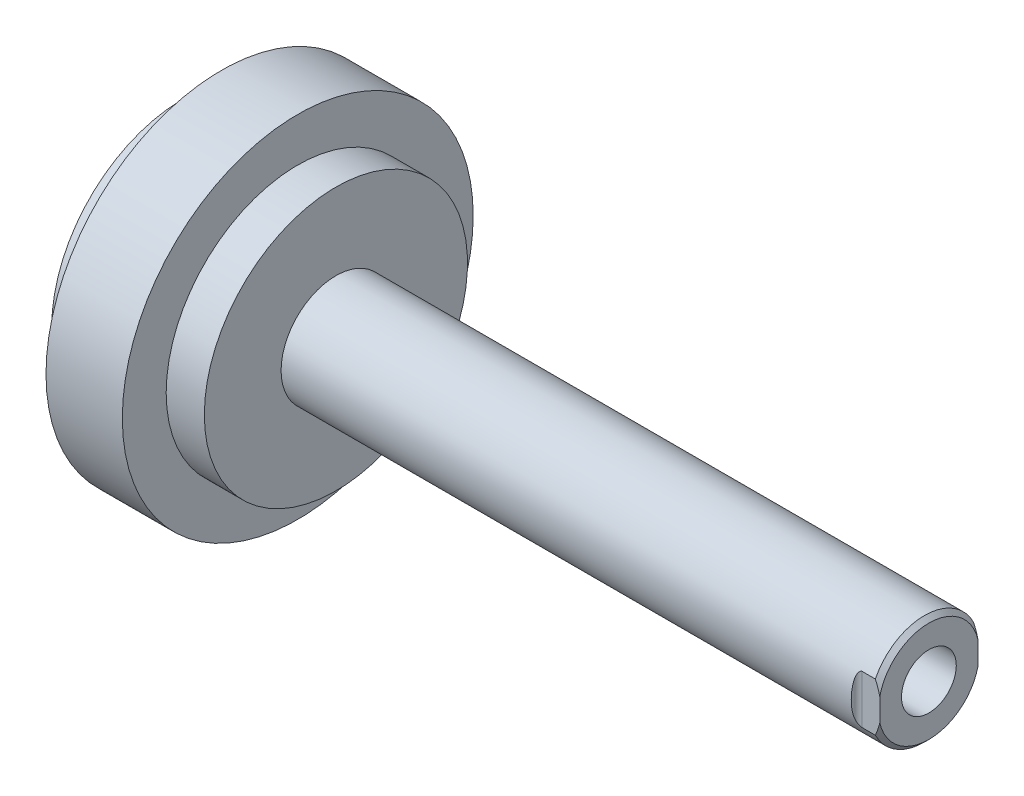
ISO-10303-21;
HEADER;
FILE_DESCRIPTION(('STEP AP214'),'2;1');
FILE_NAME('part.step','',(''),(''),'','','');
FILE_SCHEMA(('AUTOMOTIVE_DESIGN { 1 0 10303 214 1 1 1 1 }'));
ENDSEC;
DATA;
#1=APPLICATION_CONTEXT('core data for automotive mechanical design processes');
#2=APPLICATION_PROTOCOL_DEFINITION('international standard','automotive_design',2000,#1);
#3=PRODUCT_CONTEXT('',#1,'mechanical');
#4=PRODUCT('Part','Part','',(#3));
#5=PRODUCT_RELATED_PRODUCT_CATEGORY('part','',(#4));
#6=PRODUCT_DEFINITION_FORMATION('','',#4);
#7=PRODUCT_DEFINITION_CONTEXT('part definition',#1,'design');
#8=PRODUCT_DEFINITION('design','',#6,#7);
#9=PRODUCT_DEFINITION_SHAPE('','',#8);
#10=(LENGTH_UNIT() NAMED_UNIT(*) SI_UNIT(.MILLI.,.METRE.));
#11=(NAMED_UNIT(*) PLANE_ANGLE_UNIT() SI_UNIT($,.RADIAN.));
#12=(NAMED_UNIT(*) SI_UNIT($,.STERADIAN.) SOLID_ANGLE_UNIT());
#13=UNCERTAINTY_MEASURE_WITH_UNIT(LENGTH_MEASURE(1.E-05),#10,'distance_accuracy_value','');
#14=(GEOMETRIC_REPRESENTATION_CONTEXT(3) GLOBAL_UNCERTAINTY_ASSIGNED_CONTEXT((#13)) GLOBAL_UNIT_ASSIGNED_CONTEXT((#10,
#11,#12)) REPRESENTATION_CONTEXT('',''));
#15=CARTESIAN_POINT('',(0.,0.,0.));
#16=DIRECTION('',(0.,0.,1.));
#17=DIRECTION('',(1.,0.,0.));
#18=AXIS2_PLACEMENT_3D('',#15,#16,#17);
#19=CARTESIAN_POINT('',(0.,0.,0.));
#20=DIRECTION('',(1.,0.,0.));
#21=DIRECTION('',(0.,0.,-1.));
#22=AXIS2_PLACEMENT_3D('',#19,#20,#21);
#23=PLANE('',#22);
#24=CARTESIAN_POINT('',(0.,0.,0.));
#25=DIRECTION('',(-1.,0.,0.));
#26=DIRECTION('',(0.,0.,1.));
#27=AXIS2_PLACEMENT_3D('',#24,#25,#26);
#28=CIRCLE('',#27,19.05);
#29=CARTESIAN_POINT('',(0.,0.,19.05));
#30=VERTEX_POINT('',#29);
#31=EDGE_CURVE('E155',#30,#30,#28,.T.);
#32=ORIENTED_EDGE('',*,*,#31,.T.);
#33=EDGE_LOOP('',(#32));
#34=FACE_BOUND('',#33,.T.);
#35=ADVANCED_FACE('F31',(#34),#23,.F.);
#36=CARTESIAN_POINT('',(0.,0.,0.));
#37=DIRECTION('',(-1.,0.,0.));
#38=DIRECTION('',(0.,0.,1.));
#39=AXIS2_PLACEMENT_3D('',#36,#37,#38);
#40=CYLINDRICAL_SURFACE('',#39,19.05);
#41=ORIENTED_EDGE('',*,*,#31,.F.);
#42=EDGE_LOOP('',(#41));
#43=FACE_BOUND('',#42,.T.);
#44=CARTESIAN_POINT('',(5.5245,0.,0.));
#45=DIRECTION('',(-1.,0.,0.));
#46=DIRECTION('',(0.,0.,1.));
#47=AXIS2_PLACEMENT_3D('',#44,#45,#46);
#48=CIRCLE('',#47,19.05);
#49=CARTESIAN_POINT('',(5.5245,0.,19.05));
#50=VERTEX_POINT('',#49);
#51=EDGE_CURVE('E152',#50,#50,#48,.T.);
#52=ORIENTED_EDGE('',*,*,#51,.T.);
#53=EDGE_LOOP('',(#52));
#54=FACE_BOUND('',#53,.T.);
#55=ADVANCED_FACE('F244',(#43,#54),#40,.T.);
#56=CARTESIAN_POINT('',(5.5245,19.05,0.));
#57=DIRECTION('',(1.,0.,0.));
#58=DIRECTION('',(0.,0.,-1.));
#59=AXIS2_PLACEMENT_3D('',#56,#57,#58);
#60=PLANE('',#59);
#61=ORIENTED_EDGE('',*,*,#51,.F.);
#62=EDGE_LOOP('',(#61));
#63=FACE_BOUND('',#62,.T.);
#64=CARTESIAN_POINT('',(5.5245,0.,0.));
#65=DIRECTION('',(-1.,0.,0.));
#66=DIRECTION('',(0.,0.,1.));
#67=AXIS2_PLACEMENT_3D('',#64,#65,#66);
#68=CIRCLE('',#67,25.4);
#69=CARTESIAN_POINT('',(5.5245,0.,25.4));
#70=VERTEX_POINT('',#69);
#71=EDGE_CURVE('E149',#70,#70,#68,.T.);
#72=ORIENTED_EDGE('',*,*,#71,.T.);
#73=EDGE_LOOP('',(#72));
#74=FACE_BOUND('',#73,.T.);
#75=ADVANCED_FACE('F249',(#63,#74),#60,.F.);
#76=CARTESIAN_POINT('',(0.,0.,0.));
#77=DIRECTION('',(-1.,0.,0.));
#78=DIRECTION('',(0.,0.,1.));
#79=AXIS2_PLACEMENT_3D('',#76,#77,#78);
#80=CYLINDRICAL_SURFACE('',#79,25.4);
#81=ORIENTED_EDGE('',*,*,#71,.F.);
#82=EDGE_LOOP('',(#81));
#83=FACE_BOUND('',#82,.T.);
#84=CARTESIAN_POINT('',(16.5735,0.,0.));
#85=DIRECTION('',(-1.,0.,0.));
#86=DIRECTION('',(0.,0.,1.));
#87=AXIS2_PLACEMENT_3D('',#84,#85,#86);
#88=CIRCLE('',#87,25.4);
#89=CARTESIAN_POINT('',(16.5735,0.,25.4));
#90=VERTEX_POINT('',#89);
#91=EDGE_CURVE('E146',#90,#90,#88,.T.);
#92=ORIENTED_EDGE('',*,*,#91,.T.);
#93=EDGE_LOOP('',(#92));
#94=FACE_BOUND('',#93,.T.);
#95=ADVANCED_FACE('F257',(#83,#94),#80,.T.);
#96=CARTESIAN_POINT('',(16.5735,25.4,0.));
#97=DIRECTION('',(-1.,0.,0.));
#98=DIRECTION('',(0.,0.,1.));
#99=AXIS2_PLACEMENT_3D('',#96,#97,#98);
#100=PLANE('',#99);
#101=ORIENTED_EDGE('',*,*,#91,.F.);
#102=EDGE_LOOP('',(#101));
#103=FACE_BOUND('',#102,.T.);
#104=CARTESIAN_POINT('',(16.5735,0.,0.));
#105=DIRECTION('',(-1.,0.,0.));
#106=DIRECTION('',(0.,0.,1.));
#107=AXIS2_PLACEMENT_3D('',#104,#105,#106);
#108=CIRCLE('',#107,19.05);
#109=CARTESIAN_POINT('',(16.5735,0.,19.05));
#110=VERTEX_POINT('',#109);
#111=EDGE_CURVE('E143',#110,#110,#108,.T.);
#112=ORIENTED_EDGE('',*,*,#111,.T.);
#113=EDGE_LOOP('',(#112));
#114=FACE_BOUND('',#113,.T.);
#115=ADVANCED_FACE('F263',(#103,#114),#100,.F.);
#116=CARTESIAN_POINT('',(0.,0.,0.));
#117=DIRECTION('',(-1.,0.,0.));
#118=DIRECTION('',(0.,0.,1.));
#119=AXIS2_PLACEMENT_3D('',#116,#117,#118);
#120=CYLINDRICAL_SURFACE('',#119,19.05);
#121=ORIENTED_EDGE('',*,*,#111,.F.);
#122=EDGE_LOOP('',(#121));
#123=FACE_BOUND('',#122,.T.);
#124=CARTESIAN_POINT('',(22.098,0.,0.));
#125=DIRECTION('',(-1.,0.,0.));
#126=DIRECTION('',(0.,0.,1.));
#127=AXIS2_PLACEMENT_3D('',#124,#125,#126);
#128=CIRCLE('',#127,19.05);
#129=CARTESIAN_POINT('',(22.098,0.,19.05));
#130=VERTEX_POINT('',#129);
#131=EDGE_CURVE('E140',#130,#130,#128,.T.);
#132=ORIENTED_EDGE('',*,*,#131,.T.);
#133=EDGE_LOOP('',(#132));
#134=FACE_BOUND('',#133,.T.);
#135=ADVANCED_FACE('F269',(#123,#134),#120,.T.);
#136=CARTESIAN_POINT('',(22.098,19.05,0.));
#137=DIRECTION('',(-1.,0.,0.));
#138=DIRECTION('',(0.,0.,1.));
#139=AXIS2_PLACEMENT_3D('',#136,#137,#138);
#140=PLANE('',#139);
#141=ORIENTED_EDGE('',*,*,#131,.F.);
#142=EDGE_LOOP('',(#141));
#143=FACE_BOUND('',#142,.T.);
#144=CARTESIAN_POINT('',(22.098,0.,0.));
#145=DIRECTION('',(-1.,0.,0.));
#146=DIRECTION('',(0.,0.,1.));
#147=AXIS2_PLACEMENT_3D('',#144,#145,#146);
#148=CIRCLE('',#147,7.9375);
#149=CARTESIAN_POINT('',(22.098,0.,7.9375));
#150=VERTEX_POINT('',#149);
#151=EDGE_CURVE('E135',#150,#150,#148,.T.);
#152=ORIENTED_EDGE('',*,*,#151,.T.);
#153=EDGE_LOOP('',(#152));
#154=FACE_BOUND('',#153,.T.);
#155=ADVANCED_FACE('F240',(#143,#154),#140,.F.);
#156=CARTESIAN_POINT('',(0.,0.,0.));
#157=DIRECTION('',(-1.,0.,0.));
#158=DIRECTION('',(0.,0.,1.));
#159=AXIS2_PLACEMENT_3D('',#156,#157,#158);
#160=CYLINDRICAL_SURFACE('',#159,7.9375);
#161=DIRECTION('',(1.,0.,0.));
#162=VECTOR('',#161,1.);
#163=CARTESIAN_POINT('',(104.648,-3.52467902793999,-7.112));
#164=LINE('',#163,#162);
#165=CARTESIAN_POINT('',(105.41,-3.52467902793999,-7.112));
#166=VERTEX_POINT('',#165);
#167=CARTESIAN_POINT('',(107.315,-3.52467902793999,-7.112));
#168=VERTEX_POINT('',#167);
#169=EDGE_CURVE('E121',#166,#168,#164,.T.);
#170=ORIENTED_EDGE('',*,*,#169,.T.);
#171=CARTESIAN_POINT('',(107.315,0.,0.));
#172=DIRECTION('',(-1.,0.,0.));
#173=DIRECTION('',(0.,0.,1.));
#174=AXIS2_PLACEMENT_3D('',#171,#172,#173);
#175=CIRCLE('',#174,7.9375);
#176=CARTESIAN_POINT('',(107.315,-3.52467902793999,7.112));
#177=VERTEX_POINT('',#176);
#178=EDGE_CURVE('E213',#168,#177,#175,.T.);
#179=ORIENTED_EDGE('',*,*,#178,.T.);
#180=DIRECTION('',(1.,0.,0.));
#181=VECTOR('',#180,1.);
#182=CARTESIAN_POINT('',(104.648,-3.52467902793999,7.112));
#183=LINE('',#182,#181);
#184=CARTESIAN_POINT('',(105.41,-3.52467902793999,7.112));
#185=VERTEX_POINT('',#184);
#186=EDGE_CURVE('E129',#185,#177,#183,.T.);
#187=ORIENTED_EDGE('',*,*,#186,.F.);
#188=CARTESIAN_POINT('',(105.41,-3.52467902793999,7.112));
#189=CARTESIAN_POINT('',(105.389393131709,-3.52472338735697,7.11197555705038));
#190=CARTESIAN_POINT('',(105.36884981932,-3.5229948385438,7.11283476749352));
#191=CARTESIAN_POINT('',(105.328616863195,-3.51639896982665,7.11609912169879));
#192=CARTESIAN_POINT('',(105.308920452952,-3.51156531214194,7.11848768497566));
#193=CARTESIAN_POINT('',(105.266473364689,-3.49779743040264,7.1252639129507));
#194=CARTESIAN_POINT('',(105.243993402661,-3.48819881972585,7.12997395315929));
#195=CARTESIAN_POINT('',(105.201008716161,-3.46581273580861,7.14088265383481));
#196=CARTESIAN_POINT('',(105.180512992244,-3.45301159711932,7.1470876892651));
#197=CARTESIAN_POINT('',(105.131281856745,-3.41761770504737,7.16410167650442));
#198=CARTESIAN_POINT('',(105.103944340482,-3.39343338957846,7.17560658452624));
#199=CARTESIAN_POINT('',(105.053579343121,-3.34155343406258,7.19991349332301));
#200=CARTESIAN_POINT('',(105.030560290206,-3.31385110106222,7.21271795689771));
#201=CARTESIAN_POINT('',(104.989295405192,-3.25773675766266,7.23822875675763));
#202=CARTESIAN_POINT('',(104.970855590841,-3.22944941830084,7.2509011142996));
#203=CARTESIAN_POINT('',(104.936637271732,-3.17139259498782,7.27648153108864));
#204=CARTESIAN_POINT('',(104.920861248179,-3.14162176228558,7.28938979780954));
#205=CARTESIAN_POINT('',(104.891523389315,-3.08094278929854,7.31524355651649));
#206=CARTESIAN_POINT('',(104.87796655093,-3.05003226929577,7.32818906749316));
#207=CARTESIAN_POINT('',(104.852768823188,-2.98740756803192,7.35394106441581));
#208=CARTESIAN_POINT('',(104.841127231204,-2.9556936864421,7.36674759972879));
#209=CARTESIAN_POINT('',(104.814818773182,-2.87786450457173,7.39758243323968));
#210=CARTESIAN_POINT('',(104.801000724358,-2.83141525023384,7.41549051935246));
#211=CARTESIAN_POINT('',(104.776056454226,-2.73754991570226,7.4506539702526));
#212=CARTESIAN_POINT('',(104.764931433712,-2.69013341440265,7.46790904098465));
#213=CARTESIAN_POINT('',(104.73482163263,-2.54664118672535,7.51856424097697));
#214=CARTESIAN_POINT('',(104.719144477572,-2.44945877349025,7.55080026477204));
#215=CARTESIAN_POINT('',(104.693778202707,-2.25283918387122,7.611785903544));
#216=CARTESIAN_POINT('',(104.684115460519,-2.15339403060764,7.64051972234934));
#217=CARTESIAN_POINT('',(104.669006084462,-1.95313635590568,7.69414796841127));
#218=CARTESIAN_POINT('',(104.663560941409,-1.85232336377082,7.71904103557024));
#219=CARTESIAN_POINT('',(104.654580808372,-1.62672734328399,7.77006434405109));
#220=CARTESIAN_POINT('',(104.65175856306,-1.50169074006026,7.79519602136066));
#221=CARTESIAN_POINT('',(104.649298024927,-1.31400592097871,7.82823580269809));
#222=CARTESIAN_POINT('',(104.648771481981,-1.25175771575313,7.83843021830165));
#223=CARTESIAN_POINT('',(104.648124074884,-1.12704331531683,7.8573313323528));
#224=CARTESIAN_POINT('',(104.648003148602,-1.06457715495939,7.86603825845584));
#225=CARTESIAN_POINT('',(104.648,-1.00201309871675,7.874));
#226=B_SPLINE_CURVE_WITH_KNOTS('',3,(#188,#189,#190,#191,#192,#193,#194,#195,#196,#197,#198,
#199,#200,#201,#202,#203,#204,#205,#206,#207,#208,#209,#210,#211,#212,#213,#214,#215,#216,#217,
#218,#219,#220,#221,#222,#223,#224,#225),.UNSPECIFIED.,.F.,.F.,(4,2,2,2,2,2,2,2,2,2,2,2,2,2,2,2,
2,2,4),(0.,0.0616275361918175,0.12259799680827,0.196865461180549,0.271455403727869,
0.385620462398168,0.500006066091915,0.608044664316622,0.716183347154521,0.824562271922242,
0.932901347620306,1.08778207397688,1.24273173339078,1.55308619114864,1.86479236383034,
2.17660866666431,2.55910456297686,2.74832823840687,2.93752292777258),.UNSPECIFIED.);
#227=CARTESIAN_POINT('',(104.648,-1.00201309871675,7.874));
#228=VERTEX_POINT('',#227);
#229=EDGE_CURVE('E205',#185,#228,#226,.T.);
#230=ORIENTED_EDGE('',*,*,#229,.T.);
#231=CARTESIAN_POINT('',(104.648,0.,0.));
#232=DIRECTION('',(1.,0.,0.));
#233=DIRECTION('',(0.,0.,-1.));
#234=AXIS2_PLACEMENT_3D('',#231,#232,#233);
#235=CIRCLE('',#234,7.9375);
#236=CARTESIAN_POINT('',(104.648,1.00201309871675,7.874));
#237=VERTEX_POINT('',#236);
#238=EDGE_CURVE('E126',#237,#228,#235,.T.);
#239=ORIENTED_EDGE('',*,*,#238,.F.);
#240=CARTESIAN_POINT('',(104.648,1.00201309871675,7.874));
#241=CARTESIAN_POINT('',(104.648003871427,1.06541290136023,7.86593208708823));
#242=CARTESIAN_POINT('',(104.648127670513,1.1287135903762,7.85709846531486));
#243=CARTESIAN_POINT('',(104.64879409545,1.25508781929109,7.83790442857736));
#244=CARTESIAN_POINT('',(104.649336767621,1.31816133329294,7.8275438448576));
#245=CARTESIAN_POINT('',(104.651866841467,1.50736876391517,7.79411224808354));
#246=CARTESIAN_POINT('',(104.65475851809,1.63309414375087,7.76874169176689));
#247=CARTESIAN_POINT('',(104.664863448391,1.88302817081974,7.71197240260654));
#248=CARTESIAN_POINT('',(104.672076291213,2.00723696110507,7.68057424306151));
#249=CARTESIAN_POINT('',(104.688187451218,2.19178973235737,7.62915730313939));
#250=CARTESIAN_POINT('',(104.694434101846,2.25297510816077,7.61131124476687));
#251=CARTESIAN_POINT('',(104.709155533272,2.37464884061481,7.57423193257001));
#252=CARTESIAN_POINT('',(104.717629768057,2.43513736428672,7.5549990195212));
#253=CARTESIAN_POINT('',(104.732681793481,2.52667356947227,7.52468795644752));
#254=CARTESIAN_POINT('',(104.738245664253,2.55804548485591,7.51408021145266));
#255=CARTESIAN_POINT('',(104.750247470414,2.6205073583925,7.4925255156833));
#256=CARTESIAN_POINT('',(104.756685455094,2.65159730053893,7.48157854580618));
#257=CARTESIAN_POINT('',(104.777514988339,2.74452496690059,7.44820980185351));
#258=CARTESIAN_POINT('',(104.793397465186,2.80586337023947,7.42531230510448));
#259=CARTESIAN_POINT('',(104.83364678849,2.93762418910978,7.3742857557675));
#260=CARTESIAN_POINT('',(104.859028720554,3.00768254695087,7.34595964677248));
#261=CARTESIAN_POINT('',(104.904641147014,3.1091531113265,7.30331608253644));
#262=CARTESIAN_POINT('',(104.921064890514,3.14231627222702,7.28910203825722));
#263=CARTESIAN_POINT('',(104.956968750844,3.20701376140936,7.26086817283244));
#264=CARTESIAN_POINT('',(104.976445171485,3.23854999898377,7.24684813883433));
#265=CARTESIAN_POINT('',(105.01415492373,3.29221538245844,7.22259509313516));
#266=CARTESIAN_POINT('',(105.031620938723,3.31482457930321,7.21224069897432));
#267=CARTESIAN_POINT('',(105.069143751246,3.35818471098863,7.1921534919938));
#268=CARTESIAN_POINT('',(105.089203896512,3.37893318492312,7.18242150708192));
#269=CARTESIAN_POINT('',(105.132512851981,3.41797600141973,7.16392473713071));
#270=CARTESIAN_POINT('',(105.155796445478,3.4362385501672,7.15517269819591));
#271=CARTESIAN_POINT('',(105.205578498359,3.46874030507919,7.13947287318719));
#272=CARTESIAN_POINT('',(105.232067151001,3.48299136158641,7.13251977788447));
#273=CARTESIAN_POINT('',(105.278530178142,3.50202394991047,7.12318797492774));
#274=CARTESIAN_POINT('',(105.297707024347,3.50837839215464,7.12005721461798));
#275=CARTESIAN_POINT('',(105.336954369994,3.5181088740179,7.11525457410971));
#276=CARTESIAN_POINT('',(105.357022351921,3.52149280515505,7.11357882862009));
#277=CARTESIAN_POINT('',(105.388136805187,3.52420796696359,7.11223331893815));
#278=CARTESIAN_POINT('',(105.399069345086,3.52468911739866,7.11199454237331));
#279=CARTESIAN_POINT('',(105.41,3.52467902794,7.112));
#280=B_SPLINE_CURVE_WITH_KNOTS('',3,(#240,#241,#242,#243,#244,#245,#246,#247,#248,#249,#250,
#251,#252,#253,#254,#255,#256,#257,#258,#259,#260,#261,#262,#263,#264,#265,#266,#267,#268,#269,
#270,#271,#272,#273,#274,#275,#276,#277,#278,#279),.UNSPECIFIED.,.F.,.F.,(4,2,2,2,2,2,2,2,2,2,2,
2,2,2,2,2,2,2,2,4),(0.,0.191724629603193,0.383470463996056,0.768156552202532,1.15280607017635,
1.34488375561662,1.53691440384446,1.63764530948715,1.73838189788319,1.94035629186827,
2.17886889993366,2.29769013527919,2.41636859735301,2.50740102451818,2.59855212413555,
2.69077713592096,2.78272677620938,2.84381507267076,2.90474058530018,2.93752824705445),.UNSPECIFIED.);
#281=CARTESIAN_POINT('',(105.41,3.52467902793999,7.112));
#282=VERTEX_POINT('',#281);
#283=EDGE_CURVE('E200',#237,#282,#280,.T.);
#284=ORIENTED_EDGE('',*,*,#283,.T.);
#285=DIRECTION('',(1.,0.,0.));
#286=VECTOR('',#285,1.);
#287=CARTESIAN_POINT('',(104.648,3.52467902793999,7.112));
#288=LINE('',#287,#286);
#289=CARTESIAN_POINT('',(107.315,3.52467902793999,7.112));
#290=VERTEX_POINT('',#289);
#291=EDGE_CURVE('E132',#282,#290,#288,.T.);
#292=ORIENTED_EDGE('',*,*,#291,.T.);
#293=CARTESIAN_POINT('',(107.315,0.,0.));
#294=DIRECTION('',(-1.,0.,0.));
#295=DIRECTION('',(0.,0.,1.));
#296=AXIS2_PLACEMENT_3D('',#293,#294,#295);
#297=CIRCLE('',#296,7.9375);
#298=CARTESIAN_POINT('',(107.315,3.52467902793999,-7.112));
#299=VERTEX_POINT('',#298);
#300=EDGE_CURVE('E210',#290,#299,#297,.T.);
#301=ORIENTED_EDGE('',*,*,#300,.T.);
#302=DIRECTION('',(1.,0.,0.));
#303=VECTOR('',#302,1.);
#304=CARTESIAN_POINT('',(104.648,3.52467902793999,-7.112));
#305=LINE('',#304,#303);
#306=CARTESIAN_POINT('',(105.41,3.52467902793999,-7.112));
#307=VERTEX_POINT('',#306);
#308=EDGE_CURVE('E119',#307,#299,#305,.T.);
#309=ORIENTED_EDGE('',*,*,#308,.F.);
#310=CARTESIAN_POINT('',(105.41,3.52467902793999,-7.112));
#311=CARTESIAN_POINT('',(105.389393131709,3.52472338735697,-7.11197555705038));
#312=CARTESIAN_POINT('',(105.36884981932,3.52299483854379,-7.11283476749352));
#313=CARTESIAN_POINT('',(105.328616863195,3.51639896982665,-7.11609912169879));
#314=CARTESIAN_POINT('',(105.308920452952,3.51156531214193,-7.11848768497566));
#315=CARTESIAN_POINT('',(105.266473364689,3.49779743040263,-7.12526391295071));
#316=CARTESIAN_POINT('',(105.243993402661,3.48819881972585,-7.12997395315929));
#317=CARTESIAN_POINT('',(105.201008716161,3.46581273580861,-7.14088265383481));
#318=CARTESIAN_POINT('',(105.180512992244,3.45301159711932,-7.1470876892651));
#319=CARTESIAN_POINT('',(105.131281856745,3.41761770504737,-7.16410167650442));
#320=CARTESIAN_POINT('',(105.103944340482,3.39343338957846,-7.17560658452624));
#321=CARTESIAN_POINT('',(105.053579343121,3.34155343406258,-7.19991349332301));
#322=CARTESIAN_POINT('',(105.030560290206,3.31385110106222,-7.21271795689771));
#323=CARTESIAN_POINT('',(104.989295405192,3.25773675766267,-7.23822875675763));
#324=CARTESIAN_POINT('',(104.970855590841,3.22944941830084,-7.2509011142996));
#325=CARTESIAN_POINT('',(104.936637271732,3.17139259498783,-7.27648153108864));
#326=CARTESIAN_POINT('',(104.920861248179,3.14162176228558,-7.28938979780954));
#327=CARTESIAN_POINT('',(104.891523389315,3.08094278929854,-7.31524355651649));
#328=CARTESIAN_POINT('',(104.87796655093,3.05003226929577,-7.32818906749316));
#329=CARTESIAN_POINT('',(104.852768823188,2.98740756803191,-7.35394106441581));
#330=CARTESIAN_POINT('',(104.841127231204,2.95569368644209,-7.36674759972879));
#331=CARTESIAN_POINT('',(104.814818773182,2.87786450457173,-7.39758243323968));
#332=CARTESIAN_POINT('',(104.801000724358,2.83141525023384,-7.41549051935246));
#333=CARTESIAN_POINT('',(104.776056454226,2.73754991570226,-7.4506539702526));
#334=CARTESIAN_POINT('',(104.764931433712,2.69013341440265,-7.46790904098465));
#335=CARTESIAN_POINT('',(104.73482163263,2.54664118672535,-7.51856424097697));
#336=CARTESIAN_POINT('',(104.719144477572,2.44945877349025,-7.55080026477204));
#337=CARTESIAN_POINT('',(104.693778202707,2.25283918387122,-7.611785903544));
#338=CARTESIAN_POINT('',(104.684115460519,2.15339403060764,-7.64051972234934));
#339=CARTESIAN_POINT('',(104.669006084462,1.95313635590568,-7.69414796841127));
#340=CARTESIAN_POINT('',(104.663560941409,1.85232336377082,-7.71904103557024));
#341=CARTESIAN_POINT('',(104.654580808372,1.62672734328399,-7.77006434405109));
#342=CARTESIAN_POINT('',(104.65175856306,1.50169074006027,-7.79519602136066));
#343=CARTESIAN_POINT('',(104.649298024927,1.31400592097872,-7.82823580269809));
#344=CARTESIAN_POINT('',(104.648771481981,1.25175771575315,-7.83843021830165));
#345=CARTESIAN_POINT('',(104.648124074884,1.12704331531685,-7.8573313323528));
#346=CARTESIAN_POINT('',(104.648003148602,1.06457715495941,-7.86603825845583));
#347=CARTESIAN_POINT('',(104.648,1.00201309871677,-7.874));
#348=B_SPLINE_CURVE_WITH_KNOTS('',3,(#310,#311,#312,#313,#314,#315,#316,#317,#318,#319,#320,
#321,#322,#323,#324,#325,#326,#327,#328,#329,#330,#331,#332,#333,#334,#335,#336,#337,#338,#339,
#340,#341,#342,#343,#344,#345,#346,#347),.UNSPECIFIED.,.F.,.F.,(4,2,2,2,2,2,2,2,2,2,2,2,2,2,2,2,
2,2,4),(0.,0.0616275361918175,0.12259799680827,0.196865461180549,0.271455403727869,
0.385620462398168,0.500006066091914,0.608044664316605,0.716183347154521,0.824562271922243,
0.932901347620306,1.08778207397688,1.24273173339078,1.55308619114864,1.86479236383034,
2.17660866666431,2.55910456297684,2.74832823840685,2.93752292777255),.UNSPECIFIED.);
#349=CARTESIAN_POINT('',(104.648,1.00201309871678,-7.874));
#350=VERTEX_POINT('',#349);
#351=EDGE_CURVE('E175',#307,#350,#348,.T.);
#352=ORIENTED_EDGE('',*,*,#351,.T.);
#353=CARTESIAN_POINT('',(104.648,0.,0.));
#354=DIRECTION('',(1.,0.,0.));
#355=DIRECTION('',(0.,0.,-1.));
#356=AXIS2_PLACEMENT_3D('',#353,#354,#355);
#357=CIRCLE('',#356,7.9375);
#358=CARTESIAN_POINT('',(104.648,-1.00201309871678,-7.874));
#359=VERTEX_POINT('',#358);
#360=EDGE_CURVE('E116',#359,#350,#357,.T.);
#361=ORIENTED_EDGE('',*,*,#360,.F.);
#362=CARTESIAN_POINT('',(104.648,-1.00201309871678,-7.874));
#363=CARTESIAN_POINT('',(104.648003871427,-1.06541290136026,-7.86593208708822));
#364=CARTESIAN_POINT('',(104.648127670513,-1.12871359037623,-7.85709846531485));
#365=CARTESIAN_POINT('',(104.64879409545,-1.25508781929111,-7.83790442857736));
#366=CARTESIAN_POINT('',(104.649336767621,-1.31816133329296,-7.8275438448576));
#367=CARTESIAN_POINT('',(104.651866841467,-1.50736876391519,-7.79411224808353));
#368=CARTESIAN_POINT('',(104.65475851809,-1.63309414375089,-7.76874169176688));
#369=CARTESIAN_POINT('',(104.664863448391,-1.88302817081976,-7.71197240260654));
#370=CARTESIAN_POINT('',(104.672076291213,-2.00723696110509,-7.6805742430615));
#371=CARTESIAN_POINT('',(104.688187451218,-2.1917897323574,-7.62915730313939));
#372=CARTESIAN_POINT('',(104.694434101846,-2.2529751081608,-7.61131124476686));
#373=CARTESIAN_POINT('',(104.709155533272,-2.37464884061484,-7.57423193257));
#374=CARTESIAN_POINT('',(104.717629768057,-2.43513736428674,-7.55499901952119));
#375=CARTESIAN_POINT('',(104.732681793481,-2.5266735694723,-7.52468795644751));
#376=CARTESIAN_POINT('',(104.738245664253,-2.55804548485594,-7.51408021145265));
#377=CARTESIAN_POINT('',(104.750247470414,-2.62050735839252,-7.49252551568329));
#378=CARTESIAN_POINT('',(104.756685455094,-2.65159730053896,-7.48157854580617));
#379=CARTESIAN_POINT('',(104.777514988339,-2.74452496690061,-7.4482098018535));
#380=CARTESIAN_POINT('',(104.793397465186,-2.80586337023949,-7.42531230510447));
#381=CARTESIAN_POINT('',(104.83364678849,-2.9376241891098,-7.37428575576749));
#382=CARTESIAN_POINT('',(104.859028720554,-3.00768254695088,-7.34595964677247));
#383=CARTESIAN_POINT('',(104.904641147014,-3.10915311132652,-7.30331608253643));
#384=CARTESIAN_POINT('',(104.921064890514,-3.14231627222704,-7.28910203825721));
#385=CARTESIAN_POINT('',(104.956968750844,-3.20701376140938,-7.26086817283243));
#386=CARTESIAN_POINT('',(104.976445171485,-3.23854999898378,-7.24684813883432));
#387=CARTESIAN_POINT('',(105.01415492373,-3.29221538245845,-7.22259509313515));
#388=CARTESIAN_POINT('',(105.031620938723,-3.31482457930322,-7.21224069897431));
#389=CARTESIAN_POINT('',(105.069143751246,-3.35818471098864,-7.1921534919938));
#390=CARTESIAN_POINT('',(105.089203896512,-3.37893318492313,-7.18242150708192));
#391=CARTESIAN_POINT('',(105.132512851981,-3.41797600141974,-7.1639247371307));
#392=CARTESIAN_POINT('',(105.155796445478,-3.43623855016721,-7.1551726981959));
#393=CARTESIAN_POINT('',(105.205578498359,-3.4687403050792,-7.13947287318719));
#394=CARTESIAN_POINT('',(105.232067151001,-3.48299136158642,-7.13251977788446));
#395=CARTESIAN_POINT('',(105.278530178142,-3.50202394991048,-7.12318797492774));
#396=CARTESIAN_POINT('',(105.297707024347,-3.50837839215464,-7.12005721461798));
#397=CARTESIAN_POINT('',(105.336954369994,-3.5181088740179,-7.11525457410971));
#398=CARTESIAN_POINT('',(105.357022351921,-3.52149280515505,-7.11357882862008));
#399=CARTESIAN_POINT('',(105.388136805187,-3.5242079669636,-7.11223331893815));
#400=CARTESIAN_POINT('',(105.399069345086,-3.52468911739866,-7.11199454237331));
#401=CARTESIAN_POINT('',(105.41,-3.52467902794,-7.112));
#402=B_SPLINE_CURVE_WITH_KNOTS('',3,(#362,#363,#364,#365,#366,#367,#368,#369,#370,#371,#372,
#373,#374,#375,#376,#377,#378,#379,#380,#381,#382,#383,#384,#385,#386,#387,#388,#389,#390,#391,
#392,#393,#394,#395,#396,#397,#398,#399,#400,#401),.UNSPECIFIED.,.F.,.F.,(4,2,2,2,2,2,2,2,2,2,2,
2,2,2,2,2,2,2,2,4),(0.,0.191724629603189,0.38347046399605,0.768156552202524,1.15280607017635,
1.34488375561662,1.53691440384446,1.63764530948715,1.73838189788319,1.94035629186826,
2.17886889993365,2.29769013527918,2.416368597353,2.50740102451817,2.59855212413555,
2.69077713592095,2.78272677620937,2.84381507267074,2.90474058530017,2.93752824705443),.UNSPECIFIED.);
#403=EDGE_CURVE('E168',#359,#166,#402,.T.);
#404=ORIENTED_EDGE('',*,*,#403,.T.);
#405=EDGE_LOOP('',(#170,#179,#187,#230,#239,#284,#292,#301,#309,#352,#361,#404));
#406=FACE_BOUND('',#405,.T.);
#407=ORIENTED_EDGE('',*,*,#151,.F.);
#408=EDGE_LOOP('',(#407));
#409=FACE_BOUND('',#408,.T.);
#410=ADVANCED_FACE('F180',(#406,#409),#160,.T.);
#411=CARTESIAN_POINT('',(107.95,7.9375,0.));
#412=DIRECTION('',(-1.,0.,0.));
#413=DIRECTION('',(0.,0.,1.));
#414=AXIS2_PLACEMENT_3D('',#411,#412,#413);
#415=PLANE('',#414);
#416=CARTESIAN_POINT('',(107.95,0.,0.));
#417=DIRECTION('',(1.,0.,0.));
#418=DIRECTION('',(0.,0.,-1.));
#419=AXIS2_PLACEMENT_3D('',#416,#417,#418);
#420=CIRCLE('',#419,3.96875);
#421=CARTESIAN_POINT('',(107.95,0.,-3.96875));
#422=VERTEX_POINT('',#421);
#423=EDGE_CURVE('E110',#422,#422,#420,.T.);
#424=ORIENTED_EDGE('',*,*,#423,.F.);
#425=EDGE_LOOP('',(#424));
#426=FACE_BOUND('',#425,.T.);
#427=DIRECTION('',(0.,1.,0.));
#428=VECTOR('',#427,1.);
#429=CARTESIAN_POINT('',(107.95,3.52467902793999,7.112));
#430=LINE('',#429,#428);
#431=CARTESIAN_POINT('',(107.95,-1.65709452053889,7.112));
#432=VERTEX_POINT('',#431);
#433=CARTESIAN_POINT('',(107.95,1.65709452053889,7.112));
#434=VERTEX_POINT('',#433);
#435=EDGE_CURVE('E124',#432,#434,#430,.T.);
#436=ORIENTED_EDGE('',*,*,#435,.F.);
#437=CARTESIAN_POINT('',(107.95,0.,0.));
#438=DIRECTION('',(-1.,0.,0.));
#439=DIRECTION('',(0.,0.,1.));
#440=AXIS2_PLACEMENT_3D('',#437,#438,#439);
#441=CIRCLE('',#440,7.3025);
#442=CARTESIAN_POINT('',(107.95,-1.65709452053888,-7.112));
#443=VERTEX_POINT('',#442);
#444=EDGE_CURVE('E51',#432,#443,#441,.F.);
#445=ORIENTED_EDGE('',*,*,#444,.T.);
#446=DIRECTION('',(0.,-1.,0.));
#447=VECTOR('',#446,1.);
#448=CARTESIAN_POINT('',(107.95,3.52467902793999,-7.112));
#449=LINE('',#448,#447);
#450=CARTESIAN_POINT('',(107.95,1.65709452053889,-7.112));
#451=VERTEX_POINT('',#450);
#452=EDGE_CURVE('E113',#451,#443,#449,.T.);
#453=ORIENTED_EDGE('',*,*,#452,.F.);
#454=CARTESIAN_POINT('',(107.95,0.,0.));
#455=DIRECTION('',(-1.,0.,0.));
#456=DIRECTION('',(0.,0.,1.));
#457=AXIS2_PLACEMENT_3D('',#454,#455,#456);
#458=CIRCLE('',#457,7.3025);
#459=EDGE_CURVE('E360',#451,#434,#458,.F.);
#460=ORIENTED_EDGE('',*,*,#459,.T.);
#461=EDGE_LOOP('',(#436,#445,#453,#460));
#462=FACE_BOUND('',#461,.T.);
#463=ADVANCED_FACE('F232',(#426,#462),#415,.F.);
#464=CARTESIAN_POINT('',(104.648,3.52467902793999,7.112));
#465=DIRECTION('',(0.,0.,-1.));
#466=DIRECTION('',(0.,1.,0.));
#467=AXIS2_PLACEMENT_3D('',#464,#465,#466);
#468=PLANE('',#467);
#469=ORIENTED_EDGE('',*,*,#186,.T.);
#470=CARTESIAN_POINT('',(107.315,-3.52467902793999,7.112));
#471=CARTESIAN_POINT('',(107.381868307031,-3.37407075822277,7.112));
#472=CARTESIAN_POINT('',(107.445893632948,-3.22215863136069,7.112));
#473=CARTESIAN_POINT('',(107.56716959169,-2.91607637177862,7.112));
#474=CARTESIAN_POINT('',(107.624435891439,-2.76191243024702,7.112));
#475=CARTESIAN_POINT('',(107.731448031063,-2.45091232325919,7.112));
#476=CARTESIAN_POINT('',(107.781191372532,-2.29407528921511,7.112));
#477=CARTESIAN_POINT('',(107.872237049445,-1.97757575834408,7.112));
#478=CARTESIAN_POINT('',(107.913519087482,-1.8179074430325,7.112));
#479=CARTESIAN_POINT('',(107.95,-1.65709452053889,7.112));
#480=B_SPLINE_CURVE_WITH_KNOTS('',3,(#470,#471,#472,#473,#474,#475,#476,#477,#478,#479),
.UNSPECIFIED.,.F.,.F.,(4,2,2,2,4),(0.,0.494381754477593,0.987594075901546,1.48096983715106,
1.97551562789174),.UNSPECIFIED.);
#481=EDGE_CURVE('E222',#177,#432,#480,.T.);
#482=ORIENTED_EDGE('',*,*,#481,.T.);
#483=ORIENTED_EDGE('',*,*,#435,.T.);
#484=CARTESIAN_POINT('',(107.95,1.65709452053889,7.112));
#485=CARTESIAN_POINT('',(107.913519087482,1.81790744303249,7.112));
#486=CARTESIAN_POINT('',(107.872237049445,1.97757575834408,7.112));
#487=CARTESIAN_POINT('',(107.781191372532,2.2940752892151,7.112));
#488=CARTESIAN_POINT('',(107.731448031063,2.45091232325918,7.112));
#489=CARTESIAN_POINT('',(107.624435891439,2.76191243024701,7.112));
#490=CARTESIAN_POINT('',(107.56716959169,2.91607637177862,7.112));
#491=CARTESIAN_POINT('',(107.445893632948,3.22215863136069,7.112));
#492=CARTESIAN_POINT('',(107.381868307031,3.37407075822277,7.112));
#493=CARTESIAN_POINT('',(107.315,3.52467902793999,7.112));
#494=B_SPLINE_CURVE_WITH_KNOTS('',3,(#484,#485,#486,#487,#488,#489,#490,#491,#492,#493),
.UNSPECIFIED.,.F.,.F.,(4,2,2,2,4),(0.,0.494545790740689,0.987921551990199,1.48113387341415,
1.97551562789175),.UNSPECIFIED.);
#495=EDGE_CURVE('E216',#434,#290,#494,.T.);
#496=ORIENTED_EDGE('',*,*,#495,.T.);
#497=ORIENTED_EDGE('',*,*,#291,.F.);
#498=DIRECTION('',(0.,1.,0.));
#499=VECTOR('',#498,1.);
#500=CARTESIAN_POINT('',(105.41,3.52467902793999,7.112));
#501=LINE('',#500,#499);
#502=EDGE_CURVE('E166',#282,#185,#501,.F.);
#503=ORIENTED_EDGE('',*,*,#502,.T.);
#504=EDGE_LOOP('',(#469,#482,#483,#496,#497,#503));
#505=FACE_BOUND('',#504,.T.);
#506=ADVANCED_FACE('F227',(#505),#468,.F.);
#507=CARTESIAN_POINT('',(104.648,0.,0.));
#508=DIRECTION('',(1.,0.,0.));
#509=DIRECTION('',(0.,0.,-1.));
#510=AXIS2_PLACEMENT_3D('',#507,#508,#509);
#511=PLANE('',#510);
#512=ORIENTED_EDGE('',*,*,#238,.T.);
#513=DIRECTION('',(0.,1.,0.));
#514=VECTOR('',#513,1.);
#515=CARTESIAN_POINT('',(104.648,0.,7.874));
#516=LINE('',#515,#514);
#517=EDGE_CURVE('E163',#228,#237,#516,.T.);
#518=ORIENTED_EDGE('',*,*,#517,.T.);
#519=EDGE_LOOP('',(#512,#518));
#520=FACE_BOUND('',#519,.T.);
#521=ADVANCED_FACE('F231',(#520),#511,.T.);
#522=CARTESIAN_POINT('',(104.648,3.52467902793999,-7.112));
#523=DIRECTION('',(0.,0.,1.));
#524=DIRECTION('',(1.,0.,0.));
#525=AXIS2_PLACEMENT_3D('',#522,#523,#524);
#526=PLANE('',#525);
#527=ORIENTED_EDGE('',*,*,#452,.T.);
#528=CARTESIAN_POINT('',(107.95,-1.65709452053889,-7.112));
#529=CARTESIAN_POINT('',(107.913519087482,-1.81790744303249,-7.112));
#530=CARTESIAN_POINT('',(107.872237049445,-1.97757575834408,-7.112));
#531=CARTESIAN_POINT('',(107.781191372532,-2.2940752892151,-7.112));
#532=CARTESIAN_POINT('',(107.731448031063,-2.45091232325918,-7.112));
#533=CARTESIAN_POINT('',(107.624435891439,-2.76191243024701,-7.112));
#534=CARTESIAN_POINT('',(107.56716959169,-2.91607637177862,-7.112));
#535=CARTESIAN_POINT('',(107.445893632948,-3.22215863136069,-7.112));
#536=CARTESIAN_POINT('',(107.381868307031,-3.37407075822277,-7.112));
#537=CARTESIAN_POINT('',(107.315,-3.52467902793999,-7.112));
#538=B_SPLINE_CURVE_WITH_KNOTS('',3,(#528,#529,#530,#531,#532,#533,#534,#535,#536,#537),
.UNSPECIFIED.,.F.,.F.,(4,2,2,2,4),(0.,0.494545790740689,0.987921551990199,1.48113387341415,
1.97551562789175),.UNSPECIFIED.);
#539=EDGE_CURVE('E11',#443,#168,#538,.T.);
#540=ORIENTED_EDGE('',*,*,#539,.T.);
#541=ORIENTED_EDGE('',*,*,#169,.F.);
#542=DIRECTION('',(0.,-1.,0.));
#543=VECTOR('',#542,1.);
#544=CARTESIAN_POINT('',(105.41,3.52467902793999,-7.112));
#545=LINE('',#544,#543);
#546=EDGE_CURVE('E161',#166,#307,#545,.F.);
#547=ORIENTED_EDGE('',*,*,#546,.T.);
#548=ORIENTED_EDGE('',*,*,#308,.T.);
#549=CARTESIAN_POINT('',(107.315,3.52467902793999,-7.112));
#550=CARTESIAN_POINT('',(107.381868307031,3.37407075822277,-7.112));
#551=CARTESIAN_POINT('',(107.445893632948,3.22215863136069,-7.112));
#552=CARTESIAN_POINT('',(107.56716959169,2.91607637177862,-7.112));
#553=CARTESIAN_POINT('',(107.624435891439,2.76191243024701,-7.112));
#554=CARTESIAN_POINT('',(107.731448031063,2.45091232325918,-7.112));
#555=CARTESIAN_POINT('',(107.781191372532,2.2940752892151,-7.112));
#556=CARTESIAN_POINT('',(107.872237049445,1.97757575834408,-7.112));
#557=CARTESIAN_POINT('',(107.913519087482,1.81790744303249,-7.112));
#558=CARTESIAN_POINT('',(107.95,1.65709452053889,-7.112));
#559=B_SPLINE_CURVE_WITH_KNOTS('',3,(#549,#550,#551,#552,#553,#554,#555,#556,#557,#558),
.UNSPECIFIED.,.F.,.F.,(4,2,2,2,4),(0.,0.494381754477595,0.987594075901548,1.48096983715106,
1.97551562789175),.UNSPECIFIED.);
#560=EDGE_CURVE('E44',#299,#451,#559,.T.);
#561=ORIENTED_EDGE('',*,*,#560,.T.);
#562=EDGE_LOOP('',(#527,#540,#541,#547,#548,#561));
#563=FACE_BOUND('',#562,.T.);
#564=ADVANCED_FACE('F309',(#563),#526,.F.);
#565=CARTESIAN_POINT('',(104.648,0.,0.));
#566=DIRECTION('',(1.,0.,0.));
#567=DIRECTION('',(0.,0.,-1.));
#568=AXIS2_PLACEMENT_3D('',#565,#566,#567);
#569=PLANE('',#568);
#570=ORIENTED_EDGE('',*,*,#360,.T.);
#571=DIRECTION('',(0.,-1.,0.));
#572=VECTOR('',#571,1.);
#573=CARTESIAN_POINT('',(104.648,0.,-7.874));
#574=LINE('',#573,#572);
#575=EDGE_CURVE('E158',#350,#359,#574,.T.);
#576=ORIENTED_EDGE('',*,*,#575,.T.);
#577=EDGE_LOOP('',(#570,#576));
#578=FACE_BOUND('',#577,.T.);
#579=ADVANCED_FACE('F190',(#578),#569,.T.);
#580=CARTESIAN_POINT('',(105.41,0.,-7.874));
#581=DIRECTION('',(0.,-1.,0.));
#582=DIRECTION('',(0.,0.,-1.));
#583=AXIS2_PLACEMENT_3D('',#580,#581,#582);
#584=CYLINDRICAL_SURFACE('',#583,0.762);
#585=ORIENTED_EDGE('',*,*,#351,.F.);
#586=ORIENTED_EDGE('',*,*,#546,.F.);
#587=ORIENTED_EDGE('',*,*,#403,.F.);
#588=ORIENTED_EDGE('',*,*,#575,.F.);
#589=EDGE_LOOP('',(#585,#586,#587,#588));
#590=FACE_BOUND('',#589,.T.);
#591=ADVANCED_FACE('F184',(#590),#584,.F.);
#592=CARTESIAN_POINT('',(105.41,0.,7.874));
#593=DIRECTION('',(0.,1.,0.));
#594=DIRECTION('',(0.,0.,1.));
#595=AXIS2_PLACEMENT_3D('',#592,#593,#594);
#596=CYLINDRICAL_SURFACE('',#595,0.762);
#597=ORIENTED_EDGE('',*,*,#229,.F.);
#598=ORIENTED_EDGE('',*,*,#502,.F.);
#599=ORIENTED_EDGE('',*,*,#283,.F.);
#600=ORIENTED_EDGE('',*,*,#517,.F.);
#601=EDGE_LOOP('',(#597,#598,#599,#600));
#602=FACE_BOUND('',#601,.T.);
#603=ADVANCED_FACE('F189',(#602),#596,.F.);
#604=CARTESIAN_POINT('',(107.315,0.,0.));
#605=DIRECTION('',(-1.,0.,0.));
#606=DIRECTION('',(0.,0.,1.));
#607=AXIS2_PLACEMENT_3D('',#604,#605,#606);
#608=CONICAL_SURFACE('',#607,7.9375,0.78539816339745);
#609=ORIENTED_EDGE('',*,*,#539,.F.);
#610=ORIENTED_EDGE('',*,*,#444,.F.);
#611=ORIENTED_EDGE('',*,*,#481,.F.);
#612=ORIENTED_EDGE('',*,*,#178,.F.);
#613=EDGE_LOOP('',(#609,#610,#611,#612));
#614=FACE_BOUND('',#613,.T.);
#615=ADVANCED_FACE('F196',(#614),#608,.T.);
#616=CARTESIAN_POINT('',(107.315,0.,0.));
#617=DIRECTION('',(-1.,0.,0.));
#618=DIRECTION('',(0.,0.,1.));
#619=AXIS2_PLACEMENT_3D('',#616,#617,#618);
#620=CONICAL_SURFACE('',#619,7.9375,0.78539816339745);
#621=ORIENTED_EDGE('',*,*,#495,.F.);
#622=ORIENTED_EDGE('',*,*,#459,.F.);
#623=ORIENTED_EDGE('',*,*,#560,.F.);
#624=ORIENTED_EDGE('',*,*,#300,.F.);
#625=EDGE_LOOP('',(#621,#622,#623,#624));
#626=FACE_BOUND('',#625,.T.);
#627=ADVANCED_FACE('F33',(#626),#620,.T.);
#628=CARTESIAN_POINT('',(107.95,0.,0.));
#629=DIRECTION('',(1.,0.,0.));
#630=DIRECTION('',(0.,0.,-1.));
#631=AXIS2_PLACEMENT_3D('',#628,#629,#630);
#632=CYLINDRICAL_SURFACE('',#631,3.96874999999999);
#633=CARTESIAN_POINT('',(76.2,0.,0.));
#634=DIRECTION('',(1.,0.,0.));
#635=DIRECTION('',(0.,0.,-1.));
#636=AXIS2_PLACEMENT_3D('',#633,#634,#635);
#637=CIRCLE('',#636,3.96874999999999);
#638=CARTESIAN_POINT('',(76.2,0.,-3.96874999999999));
#639=VERTEX_POINT('',#638);
#640=EDGE_CURVE('E108',#639,#639,#637,.T.);
#641=ORIENTED_EDGE('',*,*,#640,.F.);
#642=EDGE_LOOP('',(#641));
#643=FACE_BOUND('',#642,.T.);
#644=ORIENTED_EDGE('',*,*,#423,.T.);
#645=EDGE_LOOP('',(#644));
#646=FACE_BOUND('',#645,.T.);
#647=ADVANCED_FACE('F104',(#643,#646),#632,.F.);
#648=CARTESIAN_POINT('',(76.2,0.,0.));
#649=DIRECTION('',(1.,0.,0.));
#650=DIRECTION('',(0.,0.,-1.));
#651=AXIS2_PLACEMENT_3D('',#648,#649,#650);
#652=CONICAL_SURFACE('',#651,3.96874999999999,1.02974425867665);
#653=CARTESIAN_POINT('',(73.8153344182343,0.,0.));
#654=VERTEX_POINT('',#653);
#655=VERTEX_LOOP('',#654);
#656=FACE_BOUND('',#655,.T.);
#657=ORIENTED_EDGE('',*,*,#640,.T.);
#658=EDGE_LOOP('',(#657));
#659=FACE_BOUND('',#658,.T.);
#660=ADVANCED_FACE('F101',(#656,#659),#652,.F.);
#661=CLOSED_SHELL('',(#35,#55,#75,#95,#115,#135,#155,#410,#463,#506,#521,#564,#579,#591,#603,
#615,#627,#647,#660));
#662=MANIFOLD_SOLID_BREP('B2',#661);
#663=ADVANCED_BREP_SHAPE_REPRESENTATION('',(#18,#662),#14);
#664=SHAPE_DEFINITION_REPRESENTATION(#9,#663);
ENDSEC;
END-ISO-10303-21;
